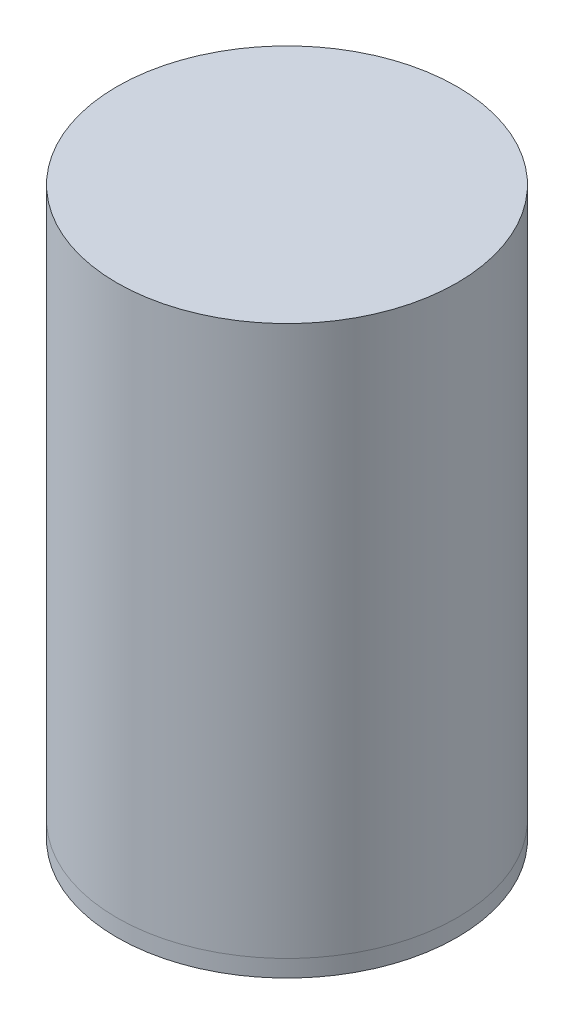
from build123d import *

# Parameters (mm, degrees)
CROQUIS1_R              = 30
SALIENTE_EXTRUIR1_DEPTH = 97
VACIADO1_T              = -1.5
CROQUIS3_R              = 25
CROQUIS3_R_2            = 18
SALIENTE_EXTRUIR2_DEPTH = 3
CROQUIS4_R              = 18
SALIENTE_EXTRUIR3_DEPTH = 1


with BuildPart() as part:
    # Croquis1 → Saliente-Extruir1 (new body)
    with BuildSketch(Plane(origin=(0, 0, 0), x_dir=(1, 0, 0), z_dir=(0, 1, 0))):
        with Locations(Location((0, 0, 0), (0, 0, 270))):
            Circle(CROQUIS1_R)
    extrude(amount=-SALIENTE_EXTRUIR1_DEPTH)

    # Vaciado1
    vaciado1_openings = [part.faces().sort_by_distance(p)[0] for p in [
        (0, -97, 0),
    ]]
    offset(amount=VACIADO1_T, openings=vaciado1_openings, kind=Kind.INTERSECTION)


with BuildPart() as body_2:
    # Croquis2 → Revoluci_n1 (revolve)
    with BuildSketch(Plane.XY):
        Polygon((-20, -94), (-28.535323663, -94), (-28.535323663, -97), (-30, -97), (-30, -100), (-26, -100), align=None)
    revolve(axis=Axis((0, -89.140472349, 0), (0, -1, 0)))


with BuildPart() as body_3:
    # Croquis3 → Saliente-Extruir2 (new body)
    with BuildSketch(Plane(origin=(0, -94, 0), x_dir=(1, 0, 0), z_dir=(0, 1, 0))):
        with Locations(Location((0, 0, 0), (0, 0, 180))):
            Circle(CROQUIS3_R)
        with Locations(Location((0, 0, 0), (0, 0, 180))):
            Circle(CROQUIS3_R_2, mode=Mode.SUBTRACT)
    extrude(amount=SALIENTE_EXTRUIR2_DEPTH)


with BuildPart() as body_4:
    # Croquis4 → Saliente-Extruir3 (new body)
    with BuildSketch(Plane.XZ.offset(94)):
        Circle(CROQUIS4_R)
    extrude(amount=-SALIENTE_EXTRUIR3_DEPTH)


solid = Compound([part.part, body_2.part, body_3.part, body_4.part])
